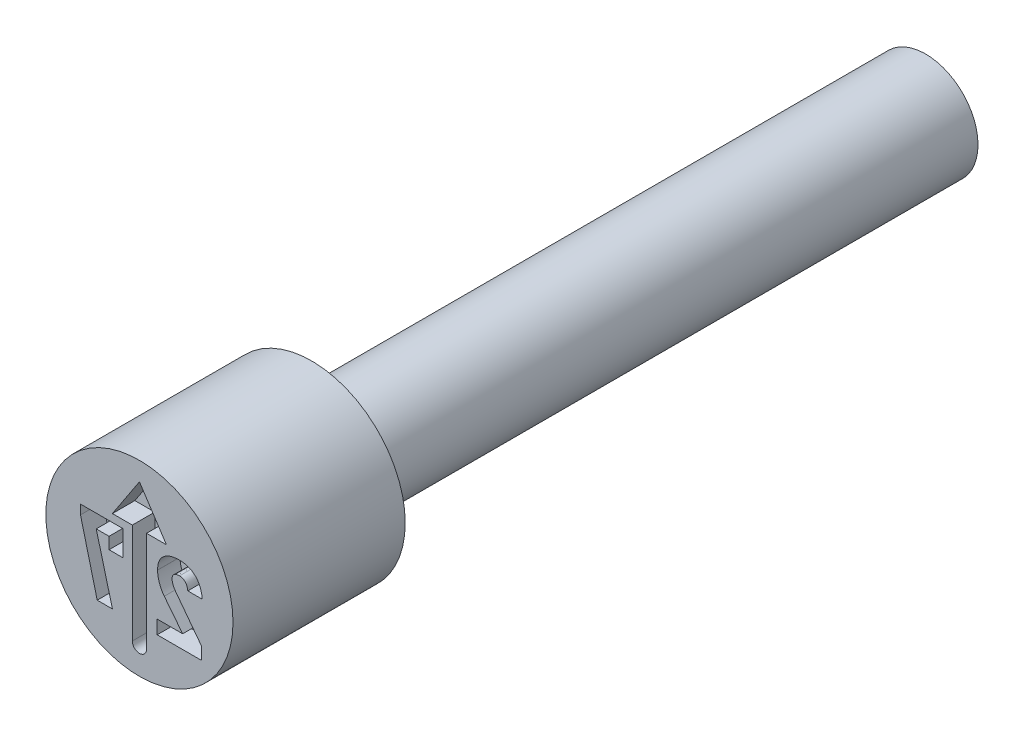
from build123d import *

# Parameters (mm, degrees)
CUT_EXTRUDE4_DEPTH = 0.3
CUT_EXTRUDE5_DEPTH = 0.3


with BuildPart() as part:
    # Sketch2 → Revolve1 (revolve)
    with BuildSketch(Plane(origin=(0, 0, 0), x_dir=(0, 0, -1), z_dir=(1, 0, 0)), mode=Mode.PRIVATE) as revolve1_sk:
        Polygon((0, 1.25), (0, 0), (10.5, 0), (10.5, 0.7), (2.3, 0.7), (2.3, 1.25), align=None)
    revolve(revolve1_sk.sketch.rotate(Axis((0, 0, -0.403888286), (0, 0, -1)), 90), axis=Axis((0, 0, -0.403888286), (0, 0, -1)))

    # Sketch3 → Cut-Extrude4 (cut)
    with BuildSketch(Plane.XY):
        with BuildLine():
            Line((0.095236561, 0.453175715), (0.095236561, -0.888080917))
            ThreePointArc((0.095236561, -0.888080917), (0, -0.983317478), (-0.095236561, -0.888080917))
            Line((-0.095236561, -0.888080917), (-0.095236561, 0.453175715))
            Line((-0.095236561, 0.453175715), (-0.360958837, 0.453175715))
            Line((-0.360958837, 0.453175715), (0, 1.001057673))
            Line((0, 1.001057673), (0.360958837, 0.453175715))
            Line((0.360958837, 0.453175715), (0.095236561, 0.453175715))
        make_face()
    extrude(amount=-CUT_EXTRUDE4_DEPTH, mode=Mode.SUBTRACT)

    # Sketch4 → Cut-Extrude5 (cut)
    with BuildSketch(Plane.XY):
        with BuildLine():
            Line((0.825933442, -0.65), (0.825933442, -0.479951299))
            Line((0.825933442, -0.479951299), (0.484212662, -0.027232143))
            add(Edge.make_bspline(
                [(0.484212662, -0.027232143), (0.47705526, -0.01714698), (0.46310928, 0.002503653), (0.450487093, 0.029489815), (0.442623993, 0.050647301), (0.438876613, 0.065990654), (0.436203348, 0.080629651), (0.435874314, 0.090248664), (0.435714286, 0.094926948)],
                knots=[0, 0, 0, 0, 1.664252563, 3.24274559, 3.998498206, 4.704056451, 5.369707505, 6, 6, 6, 6], degree=3))
            Line((0.435714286, 0.094926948), (0.435714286, 0.096347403))
            add(Edge.make_bspline(
                [(0.435714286, 0.096347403), (0.435991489, 0.102741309), (0.436522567, 0.114991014), (0.441526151, 0.132251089), (0.449726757, 0.147281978), (0.461472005, 0.159697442), (0.476093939, 0.169517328), (0.493589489, 0.176437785), (0.51372974, 0.180406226), (0.528025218, 0.1809058), (0.535551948, 0.181168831)],
                knots=[0, 0, 0, 0, 1.029992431, 1.973301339, 2.872554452, 3.768620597, 4.704316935, 5.693697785, 6.785705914, 8, 8, 8, 8], degree=3))
            add(Edge.make_bspline(
                [(0.535551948, 0.181168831), (0.542903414, 0.180881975), (0.557187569, 0.180324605), (0.577409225, 0.174147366), (0.595630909, 0.164457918), (0.611339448, 0.150632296), (0.624347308, 0.133273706), (0.634904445, 0.112832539), (0.642074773, 0.088939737), (0.644611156, 0.071836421), (0.645941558, 0.06286526)],
                knots=[0, 0, 0, 0, 0.980828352, 1.905783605, 2.800718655, 3.724477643, 4.680224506, 5.688112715, 6.78735127, 8, 8, 8, 8], degree=3))
            Line((0.645941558, 0.06286526), (0.838311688, 0.062256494))
            add(Edge.make_bspline(
                [(0.838311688, 0.062256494), (0.837362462, 0.074456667), (0.835509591, 0.097082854), (0.829435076, 0.129812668), (0.821584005, 0.160641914), (0.811596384, 0.189564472), (0.798762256, 0.21624545), (0.784342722, 0.241242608), (0.766999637, 0.263782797), (0.7480152, 0.284620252), (0.726869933, 0.302973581), (0.704323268, 0.319163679), (0.680034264, 0.332636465), (0.65437218, 0.343812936), (0.627052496, 0.352295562), (0.598432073, 0.358649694), (0.568182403, 0.36231414), (0.547534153, 0.362759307), (0.536972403, 0.362987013)],
                knots=[0, 0, 0, 0, 1.173229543, 2.290119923, 3.354877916, 4.382703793, 5.372196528, 6.339367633, 7.289741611, 8.236749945, 9.180232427, 10.11040526, 11.033485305, 11.978374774, 12.930610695, 13.916256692, 14.93414813, 16, 16, 16, 16], degree=3))
            add(Edge.make_bspline(
                [(0.536972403, 0.362987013), (0.525599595, 0.362825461), (0.50348099, 0.362511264), (0.471280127, 0.3591196), (0.44098253, 0.354000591), (0.412636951, 0.346511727), (0.386357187, 0.336743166), (0.362064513, 0.324964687), (0.339708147, 0.311075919), (0.319459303, 0.295047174), (0.301240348, 0.277169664), (0.285558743, 0.257261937), (0.271983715, 0.235726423), (0.261372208, 0.212145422), (0.252635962, 0.187073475), (0.246979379, 0.160061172), (0.243167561, 0.13142655), (0.242747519, 0.111715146), (0.242532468, 0.101623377)],
                knots=[0, 0, 0, 0, 1.219700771, 2.37215663, 3.469774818, 4.513610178, 5.512457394, 6.473141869, 7.405450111, 8.330272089, 9.238546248, 10.1372905, 11.043445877, 11.962355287, 12.905558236, 13.886315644, 14.917844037, 16, 16, 16, 16], degree=3))
            add(Edge.make_bspline(
                [(0.242532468, 0.101623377), (0.242791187, 0.089433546), (0.243309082, 0.066657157), (0.247983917, 0.032569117), (0.255517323, -0.001344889), (0.265863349, -0.034921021), (0.278715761, -0.067577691), (0.294141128, -0.098867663), (0.311550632, -0.128804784), (0.325346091, -0.147281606), (0.332224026, -0.156493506)],
                knots=[0, 0, 0, 0, 0.984368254, 1.970475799, 2.971844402, 3.988480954, 5.008197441, 6.005725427, 7.005724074, 8, 8, 8, 8], degree=3))
            Line((0.332224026, -0.156493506), (0.577353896, -0.468181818))
            Line((0.577353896, -0.468181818), (0.237053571, -0.468181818))
            Line((0.237053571, -0.468181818), (0.237053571, -0.65))
            Line((0.237053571, -0.65), (0.825933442, -0.65))
        make_face()
        Polygon((-0.787045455, 0.35), (-0.787045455, 0.224594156), (-0.563831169, -0.65), (-0.360503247, -0.65), (-0.576818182, 0.168181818), (-0.40575487, 0.168181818), (-0.40575487, 0.012337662), (-0.218051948, 0.012337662), (-0.218051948, 0.35), align=None)
    extrude(amount=-CUT_EXTRUDE5_DEPTH, mode=Mode.SUBTRACT)


solid = part.part
